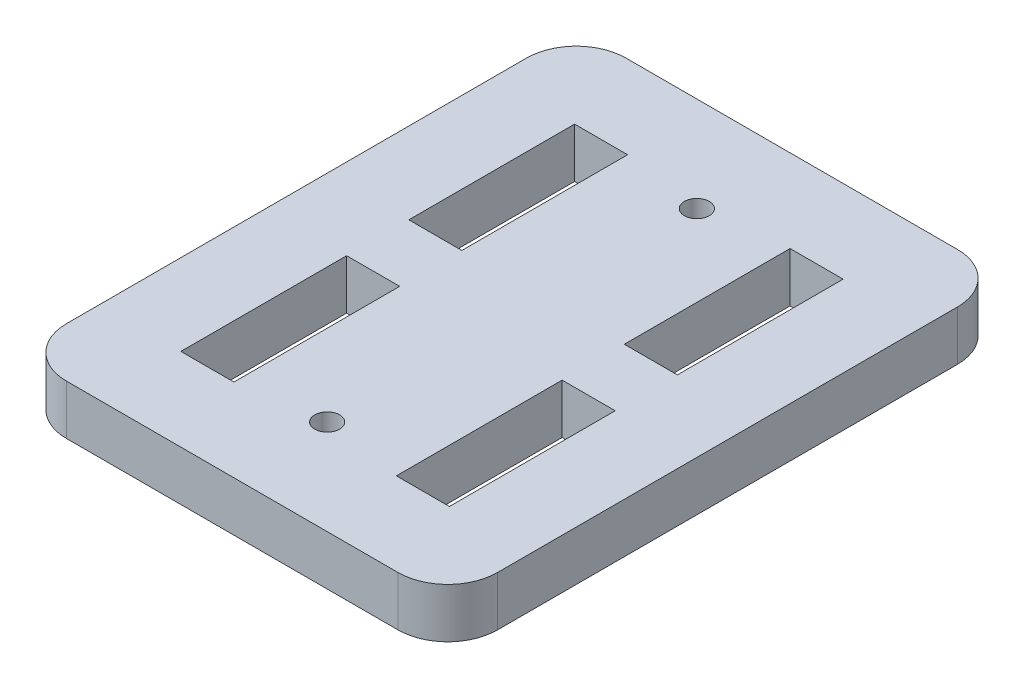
ISO-10303-21;
HEADER;
FILE_DESCRIPTION(('STEP AP214'),'2;1');
FILE_NAME('part.step','',(''),(''),'','','');
FILE_SCHEMA(('AUTOMOTIVE_DESIGN { 1 0 10303 214 1 1 1 1 }'));
ENDSEC;
DATA;
#1=APPLICATION_CONTEXT('core data for automotive mechanical design processes');
#2=APPLICATION_PROTOCOL_DEFINITION('international standard','automotive_design',2000,#1);
#3=PRODUCT_CONTEXT('',#1,'mechanical');
#4=PRODUCT('Part','Part','',(#3));
#5=PRODUCT_RELATED_PRODUCT_CATEGORY('part','',(#4));
#6=PRODUCT_DEFINITION_FORMATION('','',#4);
#7=PRODUCT_DEFINITION_CONTEXT('part definition',#1,'design');
#8=PRODUCT_DEFINITION('design','',#6,#7);
#9=PRODUCT_DEFINITION_SHAPE('','',#8);
#10=(LENGTH_UNIT() NAMED_UNIT(*) SI_UNIT(.MILLI.,.METRE.));
#11=(NAMED_UNIT(*) PLANE_ANGLE_UNIT() SI_UNIT($,.RADIAN.));
#12=(NAMED_UNIT(*) SI_UNIT($,.STERADIAN.) SOLID_ANGLE_UNIT());
#13=UNCERTAINTY_MEASURE_WITH_UNIT(LENGTH_MEASURE(1.E-05),#10,'distance_accuracy_value','');
#14=(GEOMETRIC_REPRESENTATION_CONTEXT(3) GLOBAL_UNCERTAINTY_ASSIGNED_CONTEXT((#13)) GLOBAL_UNIT_ASSIGNED_CONTEXT((#10,
#11,#12)) REPRESENTATION_CONTEXT('',''));
#15=CARTESIAN_POINT('',(0.,0.,0.));
#16=DIRECTION('',(0.,0.,1.));
#17=DIRECTION('',(1.,0.,0.));
#18=AXIS2_PLACEMENT_3D('',#15,#16,#17);
#19=CARTESIAN_POINT('',(0.,3.,0.));
#20=DIRECTION('',(0.,1.,0.));
#21=DIRECTION('',(0.,0.,1.));
#22=AXIS2_PLACEMENT_3D('',#19,#20,#21);
#23=PLANE('',#22);
#24=DIRECTION('',(0.,0.,1.));
#25=VECTOR('',#24,1.);
#26=CARTESIAN_POINT('',(16.2,3.,3.75));
#27=LINE('',#26,#25);
#28=CARTESIAN_POINT('',(16.2,3.,23.75));
#29=VERTEX_POINT('',#28);
#30=CARTESIAN_POINT('',(16.2,3.,3.75));
#31=VERTEX_POINT('',#30);
#32=EDGE_CURVE('E319',#29,#31,#27,.F.);
#33=ORIENTED_EDGE('',*,*,#32,.F.);
#34=DIRECTION('',(-1.,0.,0.));
#35=VECTOR('',#34,1.);
#36=CARTESIAN_POINT('',(16.2,3.,23.75));
#37=LINE('',#36,#35);
#38=CARTESIAN_POINT('',(9.8,3.,23.75));
#39=VERTEX_POINT('',#38);
#40=EDGE_CURVE('E306',#39,#29,#37,.F.);
#41=ORIENTED_EDGE('',*,*,#40,.F.);
#42=DIRECTION('',(0.,0.,-1.));
#43=VECTOR('',#42,1.);
#44=CARTESIAN_POINT('',(9.8,3.,23.75));
#45=LINE('',#44,#43);
#46=CARTESIAN_POINT('',(9.8,3.,3.75));
#47=VERTEX_POINT('',#46);
#48=EDGE_CURVE('E308',#47,#39,#45,.F.);
#49=ORIENTED_EDGE('',*,*,#48,.F.);
#50=DIRECTION('',(1.,0.,0.));
#51=VECTOR('',#50,1.);
#52=CARTESIAN_POINT('',(9.8,3.,3.75));
#53=LINE('',#52,#51);
#54=EDGE_CURVE('E312',#31,#47,#53,.F.);
#55=ORIENTED_EDGE('',*,*,#54,.F.);
#56=EDGE_LOOP('',(#33,#41,#49,#55));
#57=FACE_BOUND('',#56,.T.);
#58=DIRECTION('',(-1.,0.,0.));
#59=VECTOR('',#58,1.);
#60=CARTESIAN_POINT('',(-9.8,3.,23.75));
#61=LINE('',#60,#59);
#62=CARTESIAN_POINT('',(-16.2,3.,23.75));
#63=VERTEX_POINT('',#62);
#64=CARTESIAN_POINT('',(-9.8,3.,23.75));
#65=VERTEX_POINT('',#64);
#66=EDGE_CURVE('E302',#63,#65,#61,.F.);
#67=ORIENTED_EDGE('',*,*,#66,.F.);
#68=DIRECTION('',(0.,0.,-1.));
#69=VECTOR('',#68,1.);
#70=CARTESIAN_POINT('',(-16.2,3.,23.75));
#71=LINE('',#70,#69);
#72=CARTESIAN_POINT('',(-16.2,3.,3.75));
#73=VERTEX_POINT('',#72);
#74=EDGE_CURVE('E289',#73,#63,#71,.F.);
#75=ORIENTED_EDGE('',*,*,#74,.F.);
#76=DIRECTION('',(1.,0.,0.));
#77=VECTOR('',#76,1.);
#78=CARTESIAN_POINT('',(-16.2,3.,3.75));
#79=LINE('',#78,#77);
#80=CARTESIAN_POINT('',(-9.8,3.,3.75));
#81=VERTEX_POINT('',#80);
#82=EDGE_CURVE('E291',#81,#73,#79,.F.);
#83=ORIENTED_EDGE('',*,*,#82,.F.);
#84=DIRECTION('',(0.,0.,1.));
#85=VECTOR('',#84,1.);
#86=CARTESIAN_POINT('',(-9.8,3.,3.75));
#87=LINE('',#86,#85);
#88=EDGE_CURVE('E295',#65,#81,#87,.F.);
#89=ORIENTED_EDGE('',*,*,#88,.F.);
#90=EDGE_LOOP('',(#67,#75,#83,#89));
#91=FACE_BOUND('',#90,.T.);
#92=DIRECTION('',(1.,0.,0.));
#93=VECTOR('',#92,1.);
#94=CARTESIAN_POINT('',(9.8,3.,-23.75));
#95=LINE('',#94,#93);
#96=CARTESIAN_POINT('',(16.2,3.,-23.75));
#97=VERTEX_POINT('',#96);
#98=CARTESIAN_POINT('',(9.8,3.,-23.75));
#99=VERTEX_POINT('',#98);
#100=EDGE_CURVE('E285',#97,#99,#95,.F.);
#101=ORIENTED_EDGE('',*,*,#100,.F.);
#102=DIRECTION('',(0.,0.,1.));
#103=VECTOR('',#102,1.);
#104=CARTESIAN_POINT('',(16.2,3.,-23.75));
#105=LINE('',#104,#103);
#106=CARTESIAN_POINT('',(16.2,3.,-3.75));
#107=VERTEX_POINT('',#106);
#108=EDGE_CURVE('E272',#107,#97,#105,.F.);
#109=ORIENTED_EDGE('',*,*,#108,.F.);
#110=DIRECTION('',(-1.,0.,0.));
#111=VECTOR('',#110,1.);
#112=CARTESIAN_POINT('',(16.2,3.,-3.75));
#113=LINE('',#112,#111);
#114=CARTESIAN_POINT('',(9.8,3.,-3.75));
#115=VERTEX_POINT('',#114);
#116=EDGE_CURVE('E274',#115,#107,#113,.F.);
#117=ORIENTED_EDGE('',*,*,#116,.F.);
#118=DIRECTION('',(0.,0.,-1.));
#119=VECTOR('',#118,1.);
#120=CARTESIAN_POINT('',(9.8,3.,-3.75));
#121=LINE('',#120,#119);
#122=EDGE_CURVE('E278',#99,#115,#121,.F.);
#123=ORIENTED_EDGE('',*,*,#122,.F.);
#124=EDGE_LOOP('',(#101,#109,#117,#123));
#125=FACE_BOUND('',#124,.T.);
#126=DIRECTION('',(0.,0.,-1.));
#127=VECTOR('',#126,1.);
#128=CARTESIAN_POINT('',(-16.2,3.,-3.75));
#129=LINE('',#128,#127);
#130=CARTESIAN_POINT('',(-16.2,3.,-23.75));
#131=VERTEX_POINT('',#130);
#132=CARTESIAN_POINT('',(-16.2,3.,-3.75));
#133=VERTEX_POINT('',#132);
#134=EDGE_CURVE('E268',#131,#133,#129,.F.);
#135=ORIENTED_EDGE('',*,*,#134,.F.);
#136=DIRECTION('',(1.,0.,0.));
#137=VECTOR('',#136,1.);
#138=CARTESIAN_POINT('',(-16.2,3.,-23.75));
#139=LINE('',#138,#137);
#140=CARTESIAN_POINT('',(-9.8,3.,-23.75));
#141=VERTEX_POINT('',#140);
#142=EDGE_CURVE('E234',#141,#131,#139,.F.);
#143=ORIENTED_EDGE('',*,*,#142,.F.);
#144=DIRECTION('',(0.,0.,1.));
#145=VECTOR('',#144,1.);
#146=CARTESIAN_POINT('',(-9.8,3.,-23.75));
#147=LINE('',#146,#145);
#148=CARTESIAN_POINT('',(-9.8,3.,-3.75));
#149=VERTEX_POINT('',#148);
#150=EDGE_CURVE('E257',#149,#141,#147,.F.);
#151=ORIENTED_EDGE('',*,*,#150,.F.);
#152=DIRECTION('',(-1.,0.,0.));
#153=VECTOR('',#152,1.);
#154=CARTESIAN_POINT('',(-9.8,3.,-3.75));
#155=LINE('',#154,#153);
#156=EDGE_CURVE('E261',#133,#149,#155,.F.);
#157=ORIENTED_EDGE('',*,*,#156,.F.);
#158=EDGE_LOOP('',(#135,#143,#151,#157));
#159=FACE_BOUND('',#158,.T.);
#160=CARTESIAN_POINT('',(0.,3.,22.3));
#161=DIRECTION('',(0.,1.,0.));
#162=DIRECTION('',(0.,0.,1.));
#163=AXIS2_PLACEMENT_3D('',#160,#161,#162);
#164=CIRCLE('',#163,1.5);
#165=CARTESIAN_POINT('',(0.,3.,23.8));
#166=VERTEX_POINT('',#165);
#167=EDGE_CURVE('E231',#166,#166,#164,.F.);
#168=ORIENTED_EDGE('',*,*,#167,.T.);
#169=EDGE_LOOP('',(#168));
#170=FACE_BOUND('',#169,.T.);
#171=CARTESIAN_POINT('',(0.,3.,-22.3));
#172=DIRECTION('',(0.,1.,0.));
#173=DIRECTION('',(0.,0.,1.));
#174=AXIS2_PLACEMENT_3D('',#171,#172,#173);
#175=CIRCLE('',#174,1.5);
#176=CARTESIAN_POINT('',(0.,3.,-20.8));
#177=VERTEX_POINT('',#176);
#178=EDGE_CURVE('E235',#177,#177,#175,.F.);
#179=ORIENTED_EDGE('',*,*,#178,.T.);
#180=EDGE_LOOP('',(#179));
#181=FACE_BOUND('',#180,.T.);
#182=DIRECTION('',(-1.,0.,0.));
#183=VECTOR('',#182,1.);
#184=CARTESIAN_POINT('',(20.,3.,-33.75));
#185=LINE('',#184,#183);
#186=CARTESIAN_POINT('',(-20.,3.,-33.75));
#187=VERTEX_POINT('',#186);
#188=CARTESIAN_POINT('',(20.,3.,-33.75));
#189=VERTEX_POINT('',#188);
#190=EDGE_CURVE('E188',#187,#189,#185,.F.);
#191=ORIENTED_EDGE('',*,*,#190,.F.);
#192=CARTESIAN_POINT('',(-20.,3.,-27.75));
#193=DIRECTION('',(0.,1.,0.));
#194=DIRECTION('',(0.,0.,1.));
#195=AXIS2_PLACEMENT_3D('',#192,#193,#194);
#196=CIRCLE('',#195,6.);
#197=CARTESIAN_POINT('',(-26.,3.,-27.75));
#198=VERTEX_POINT('',#197);
#199=EDGE_CURVE('E20',#198,#187,#196,.F.);
#200=ORIENTED_EDGE('',*,*,#199,.F.);
#201=DIRECTION('',(0.,0.,1.));
#202=VECTOR('',#201,1.);
#203=CARTESIAN_POINT('',(-26.,3.,-27.75));
#204=LINE('',#203,#202);
#205=CARTESIAN_POINT('',(-26.,3.,27.75));
#206=VERTEX_POINT('',#205);
#207=EDGE_CURVE('E174',#206,#198,#204,.F.);
#208=ORIENTED_EDGE('',*,*,#207,.F.);
#209=CARTESIAN_POINT('',(-20.,3.,27.75));
#210=DIRECTION('',(0.,1.,0.));
#211=DIRECTION('',(0.,0.,1.));
#212=AXIS2_PLACEMENT_3D('',#209,#210,#211);
#213=CIRCLE('',#212,6.);
#214=CARTESIAN_POINT('',(-20.,3.,33.75));
#215=VERTEX_POINT('',#214);
#216=EDGE_CURVE('E195',#215,#206,#213,.F.);
#217=ORIENTED_EDGE('',*,*,#216,.F.);
#218=DIRECTION('',(1.,0.,0.));
#219=VECTOR('',#218,1.);
#220=CARTESIAN_POINT('',(-20.,3.,33.75));
#221=LINE('',#220,#219);
#222=CARTESIAN_POINT('',(20.,3.,33.75));
#223=VERTEX_POINT('',#222);
#224=EDGE_CURVE('E207',#223,#215,#221,.F.);
#225=ORIENTED_EDGE('',*,*,#224,.F.);
#226=CARTESIAN_POINT('',(20.,3.,27.75));
#227=DIRECTION('',(0.,1.,0.));
#228=DIRECTION('',(0.,0.,1.));
#229=AXIS2_PLACEMENT_3D('',#226,#227,#228);
#230=CIRCLE('',#229,6.);
#231=CARTESIAN_POINT('',(26.,3.,27.75));
#232=VERTEX_POINT('',#231);
#233=EDGE_CURVE('E241',#232,#223,#230,.F.);
#234=ORIENTED_EDGE('',*,*,#233,.F.);
#235=DIRECTION('',(0.,0.,-1.));
#236=VECTOR('',#235,1.);
#237=CARTESIAN_POINT('',(26.,3.,27.75));
#238=LINE('',#237,#236);
#239=CARTESIAN_POINT('',(26.,3.,-27.75));
#240=VERTEX_POINT('',#239);
#241=EDGE_CURVE('E203',#240,#232,#238,.F.);
#242=ORIENTED_EDGE('',*,*,#241,.F.);
#243=CARTESIAN_POINT('',(20.,3.,-27.75));
#244=DIRECTION('',(0.,1.,0.));
#245=DIRECTION('',(0.,0.,1.));
#246=AXIS2_PLACEMENT_3D('',#243,#244,#245);
#247=CIRCLE('',#246,6.);
#248=EDGE_CURVE('E238',#189,#240,#247,.F.);
#249=ORIENTED_EDGE('',*,*,#248,.F.);
#250=EDGE_LOOP('',(#191,#200,#208,#217,#225,#234,#242,#249));
#251=FACE_BOUND('',#250,.T.);
#252=ADVANCED_FACE('F17',(#57,#91,#125,#159,#170,#181,#251),#23,.T.);
#253=CARTESIAN_POINT('',(-20.,-3.,-27.75));
#254=DIRECTION('',(0.,1.,0.));
#255=DIRECTION('',(0.,0.,1.));
#256=AXIS2_PLACEMENT_3D('',#253,#254,#255);
#257=CYLINDRICAL_SURFACE('',#256,6.);
#258=DIRECTION('',(0.,1.,0.));
#259=VECTOR('',#258,1.);
#260=CARTESIAN_POINT('',(-20.,-3.,-33.75));
#261=LINE('',#260,#259);
#262=CARTESIAN_POINT('',(-20.,-3.,-33.75));
#263=VERTEX_POINT('',#262);
#264=EDGE_CURVE('E202',#263,#187,#261,.T.);
#265=ORIENTED_EDGE('',*,*,#264,.F.);
#266=CARTESIAN_POINT('',(-20.,-3.,-27.75));
#267=DIRECTION('',(0.,1.,0.));
#268=DIRECTION('',(0.,0.,1.));
#269=AXIS2_PLACEMENT_3D('',#266,#267,#268);
#270=CIRCLE('',#269,6.);
#271=CARTESIAN_POINT('',(-26.,-3.,-27.75));
#272=VERTEX_POINT('',#271);
#273=EDGE_CURVE('E194',#263,#272,#270,.T.);
#274=ORIENTED_EDGE('',*,*,#273,.T.);
#275=DIRECTION('',(0.,1.,0.));
#276=VECTOR('',#275,1.);
#277=CARTESIAN_POINT('',(-26.,-3.,-27.75));
#278=LINE('',#277,#276);
#279=EDGE_CURVE('E179',#198,#272,#278,.F.);
#280=ORIENTED_EDGE('',*,*,#279,.F.);
#281=ORIENTED_EDGE('',*,*,#199,.T.);
#282=EDGE_LOOP('',(#265,#274,#280,#281));
#283=FACE_BOUND('',#282,.T.);
#284=ADVANCED_FACE('F193',(#283),#257,.T.);
#285=CARTESIAN_POINT('',(-26.,-3.,-27.75));
#286=DIRECTION('',(-1.,0.,0.));
#287=DIRECTION('',(0.,0.,1.));
#288=AXIS2_PLACEMENT_3D('',#285,#286,#287);
#289=PLANE('',#288);
#290=ORIENTED_EDGE('',*,*,#279,.T.);
#291=DIRECTION('',(0.,0.,1.));
#292=VECTOR('',#291,1.);
#293=CARTESIAN_POINT('',(-26.,-3.,0.));
#294=LINE('',#293,#292);
#295=CARTESIAN_POINT('',(-26.,-3.,27.75));
#296=VERTEX_POINT('',#295);
#297=EDGE_CURVE('E229',#272,#296,#294,.T.);
#298=ORIENTED_EDGE('',*,*,#297,.T.);
#299=DIRECTION('',(0.,1.,0.));
#300=VECTOR('',#299,1.);
#301=CARTESIAN_POINT('',(-26.,-3.,27.75));
#302=LINE('',#301,#300);
#303=EDGE_CURVE('E181',#206,#296,#302,.F.);
#304=ORIENTED_EDGE('',*,*,#303,.F.);
#305=ORIENTED_EDGE('',*,*,#207,.T.);
#306=EDGE_LOOP('',(#290,#298,#304,#305));
#307=FACE_BOUND('',#306,.T.);
#308=ADVANCED_FACE('F176',(#307),#289,.T.);
#309=CARTESIAN_POINT('',(-20.,-3.,27.75));
#310=DIRECTION('',(0.,1.,0.));
#311=DIRECTION('',(0.,0.,1.));
#312=AXIS2_PLACEMENT_3D('',#309,#310,#311);
#313=CYLINDRICAL_SURFACE('',#312,6.);
#314=ORIENTED_EDGE('',*,*,#303,.T.);
#315=CARTESIAN_POINT('',(-20.,-3.,27.75));
#316=DIRECTION('',(0.,1.,0.));
#317=DIRECTION('',(0.,0.,1.));
#318=AXIS2_PLACEMENT_3D('',#315,#316,#317);
#319=CIRCLE('',#318,6.);
#320=CARTESIAN_POINT('',(-20.,-3.,33.75));
#321=VERTEX_POINT('',#320);
#322=EDGE_CURVE('E226',#296,#321,#319,.T.);
#323=ORIENTED_EDGE('',*,*,#322,.T.);
#324=DIRECTION('',(0.,1.,0.));
#325=VECTOR('',#324,1.);
#326=CARTESIAN_POINT('',(-20.,-3.,33.75));
#327=LINE('',#326,#325);
#328=EDGE_CURVE('E208',#215,#321,#327,.F.);
#329=ORIENTED_EDGE('',*,*,#328,.F.);
#330=ORIENTED_EDGE('',*,*,#216,.T.);
#331=EDGE_LOOP('',(#314,#323,#329,#330));
#332=FACE_BOUND('',#331,.T.);
#333=ADVANCED_FACE('F476',(#332),#313,.T.);
#334=CARTESIAN_POINT('',(-20.,-3.,33.75));
#335=DIRECTION('',(0.,0.,1.));
#336=DIRECTION('',(1.,0.,0.));
#337=AXIS2_PLACEMENT_3D('',#334,#335,#336);
#338=PLANE('',#337);
#339=ORIENTED_EDGE('',*,*,#328,.T.);
#340=DIRECTION('',(1.,0.,0.));
#341=VECTOR('',#340,1.);
#342=CARTESIAN_POINT('',(0.,-3.,33.75));
#343=LINE('',#342,#341);
#344=CARTESIAN_POINT('',(20.,-3.,33.75));
#345=VERTEX_POINT('',#344);
#346=EDGE_CURVE('E225',#321,#345,#343,.T.);
#347=ORIENTED_EDGE('',*,*,#346,.T.);
#348=DIRECTION('',(0.,1.,0.));
#349=VECTOR('',#348,1.);
#350=CARTESIAN_POINT('',(20.,-3.,33.75));
#351=LINE('',#350,#349);
#352=EDGE_CURVE('E206',#223,#345,#351,.F.);
#353=ORIENTED_EDGE('',*,*,#352,.F.);
#354=ORIENTED_EDGE('',*,*,#224,.T.);
#355=EDGE_LOOP('',(#339,#347,#353,#354));
#356=FACE_BOUND('',#355,.T.);
#357=ADVANCED_FACE('F473',(#356),#338,.T.);
#358=CARTESIAN_POINT('',(20.,-3.,27.75));
#359=DIRECTION('',(0.,1.,0.));
#360=DIRECTION('',(0.,0.,1.));
#361=AXIS2_PLACEMENT_3D('',#358,#359,#360);
#362=CYLINDRICAL_SURFACE('',#361,6.);
#363=ORIENTED_EDGE('',*,*,#352,.T.);
#364=CARTESIAN_POINT('',(20.,-3.,27.75));
#365=DIRECTION('',(0.,1.,0.));
#366=DIRECTION('',(0.,0.,1.));
#367=AXIS2_PLACEMENT_3D('',#364,#365,#366);
#368=CIRCLE('',#367,6.);
#369=CARTESIAN_POINT('',(26.,-3.,27.75));
#370=VERTEX_POINT('',#369);
#371=EDGE_CURVE('E222',#345,#370,#368,.T.);
#372=ORIENTED_EDGE('',*,*,#371,.T.);
#373=DIRECTION('',(0.,1.,0.));
#374=VECTOR('',#373,1.);
#375=CARTESIAN_POINT('',(26.,-3.,27.75));
#376=LINE('',#375,#374);
#377=EDGE_CURVE('E205',#232,#370,#376,.F.);
#378=ORIENTED_EDGE('',*,*,#377,.F.);
#379=ORIENTED_EDGE('',*,*,#233,.T.);
#380=EDGE_LOOP('',(#363,#372,#378,#379));
#381=FACE_BOUND('',#380,.T.);
#382=ADVANCED_FACE('F469',(#381),#362,.T.);
#383=CARTESIAN_POINT('',(26.,-3.,27.75));
#384=DIRECTION('',(1.,0.,0.));
#385=DIRECTION('',(0.,0.,-1.));
#386=AXIS2_PLACEMENT_3D('',#383,#384,#385);
#387=PLANE('',#386);
#388=ORIENTED_EDGE('',*,*,#377,.T.);
#389=DIRECTION('',(0.,0.,1.));
#390=VECTOR('',#389,1.);
#391=CARTESIAN_POINT('',(26.,-3.,0.));
#392=LINE('',#391,#390);
#393=CARTESIAN_POINT('',(26.,-3.,-27.75));
#394=VERTEX_POINT('',#393);
#395=EDGE_CURVE('E221',#370,#394,#392,.F.);
#396=ORIENTED_EDGE('',*,*,#395,.T.);
#397=DIRECTION('',(0.,1.,0.));
#398=VECTOR('',#397,1.);
#399=CARTESIAN_POINT('',(26.,-3.,-27.75));
#400=LINE('',#399,#398);
#401=EDGE_CURVE('E240',#240,#394,#400,.F.);
#402=ORIENTED_EDGE('',*,*,#401,.F.);
#403=ORIENTED_EDGE('',*,*,#241,.T.);
#404=EDGE_LOOP('',(#388,#396,#402,#403));
#405=FACE_BOUND('',#404,.T.);
#406=ADVANCED_FACE('F465',(#405),#387,.T.);
#407=CARTESIAN_POINT('',(20.,-3.,-27.75));
#408=DIRECTION('',(0.,1.,0.));
#409=DIRECTION('',(0.,0.,1.));
#410=AXIS2_PLACEMENT_3D('',#407,#408,#409);
#411=CYLINDRICAL_SURFACE('',#410,6.);
#412=ORIENTED_EDGE('',*,*,#401,.T.);
#413=CARTESIAN_POINT('',(20.,-3.,-27.75));
#414=DIRECTION('',(0.,1.,0.));
#415=DIRECTION('',(0.,0.,1.));
#416=AXIS2_PLACEMENT_3D('',#413,#414,#415);
#417=CIRCLE('',#416,6.);
#418=CARTESIAN_POINT('',(20.,-3.,-33.75));
#419=VERTEX_POINT('',#418);
#420=EDGE_CURVE('E218',#394,#419,#417,.T.);
#421=ORIENTED_EDGE('',*,*,#420,.T.);
#422=DIRECTION('',(0.,1.,0.));
#423=VECTOR('',#422,1.);
#424=CARTESIAN_POINT('',(20.,-3.,-33.75));
#425=LINE('',#424,#423);
#426=EDGE_CURVE('E201',#189,#419,#425,.F.);
#427=ORIENTED_EDGE('',*,*,#426,.F.);
#428=ORIENTED_EDGE('',*,*,#248,.T.);
#429=EDGE_LOOP('',(#412,#421,#427,#428));
#430=FACE_BOUND('',#429,.T.);
#431=ADVANCED_FACE('F461',(#430),#411,.T.);
#432=CARTESIAN_POINT('',(20.,-3.,-33.75));
#433=DIRECTION('',(0.,0.,-1.));
#434=DIRECTION('',(-1.,0.,0.));
#435=AXIS2_PLACEMENT_3D('',#432,#433,#434);
#436=PLANE('',#435);
#437=ORIENTED_EDGE('',*,*,#426,.T.);
#438=DIRECTION('',(1.,0.,0.));
#439=VECTOR('',#438,1.);
#440=CARTESIAN_POINT('',(0.,-3.,-33.75));
#441=LINE('',#440,#439);
#442=EDGE_CURVE('E217',#419,#263,#441,.F.);
#443=ORIENTED_EDGE('',*,*,#442,.T.);
#444=ORIENTED_EDGE('',*,*,#264,.T.);
#445=ORIENTED_EDGE('',*,*,#190,.T.);
#446=EDGE_LOOP('',(#437,#443,#444,#445));
#447=FACE_BOUND('',#446,.T.);
#448=ADVANCED_FACE('F457',(#447),#436,.T.);
#449=CARTESIAN_POINT('',(0.,-3.,-22.3));
#450=DIRECTION('',(0.,1.,0.));
#451=DIRECTION('',(0.,0.,1.));
#452=AXIS2_PLACEMENT_3D('',#449,#450,#451);
#453=CYLINDRICAL_SURFACE('',#452,1.5);
#454=ORIENTED_EDGE('',*,*,#178,.F.);
#455=EDGE_LOOP('',(#454));
#456=FACE_BOUND('',#455,.T.);
#457=CARTESIAN_POINT('',(0.,-3.,-22.3));
#458=DIRECTION('',(0.,1.,0.));
#459=DIRECTION('',(0.,0.,1.));
#460=AXIS2_PLACEMENT_3D('',#457,#458,#459);
#461=CIRCLE('',#460,1.5);
#462=CARTESIAN_POINT('',(0.,-3.,-20.8));
#463=VERTEX_POINT('',#462);
#464=EDGE_CURVE('E214',#463,#463,#461,.F.);
#465=ORIENTED_EDGE('',*,*,#464,.T.);
#466=EDGE_LOOP('',(#465));
#467=FACE_BOUND('',#466,.T.);
#468=ADVANCED_FACE('F453',(#456,#467),#453,.F.);
#469=CARTESIAN_POINT('',(0.,-3.,22.3));
#470=DIRECTION('',(0.,1.,0.));
#471=DIRECTION('',(0.,0.,1.));
#472=AXIS2_PLACEMENT_3D('',#469,#470,#471);
#473=CYLINDRICAL_SURFACE('',#472,1.5);
#474=ORIENTED_EDGE('',*,*,#167,.F.);
#475=EDGE_LOOP('',(#474));
#476=FACE_BOUND('',#475,.T.);
#477=CARTESIAN_POINT('',(0.,-3.,22.3));
#478=DIRECTION('',(0.,1.,0.));
#479=DIRECTION('',(0.,0.,1.));
#480=AXIS2_PLACEMENT_3D('',#477,#478,#479);
#481=CIRCLE('',#480,1.5);
#482=CARTESIAN_POINT('',(0.,-3.,23.8));
#483=VERTEX_POINT('',#482);
#484=EDGE_CURVE('E210',#483,#483,#481,.F.);
#485=ORIENTED_EDGE('',*,*,#484,.T.);
#486=EDGE_LOOP('',(#485));
#487=FACE_BOUND('',#486,.T.);
#488=ADVANCED_FACE('F449',(#476,#487),#473,.F.);
#489=CARTESIAN_POINT('',(-16.2,-3.,-23.75));
#490=DIRECTION('',(0.,0.,1.));
#491=DIRECTION('',(1.,0.,0.));
#492=AXIS2_PLACEMENT_3D('',#489,#490,#491);
#493=PLANE('',#492);
#494=DIRECTION('',(0.,1.,0.));
#495=VECTOR('',#494,1.);
#496=CARTESIAN_POINT('',(-16.2,-3.,-23.75));
#497=LINE('',#496,#495);
#498=CARTESIAN_POINT('',(-16.2,-3.,-23.75));
#499=VERTEX_POINT('',#498);
#500=EDGE_CURVE('E265',#499,#131,#497,.T.);
#501=ORIENTED_EDGE('',*,*,#500,.F.);
#502=DIRECTION('',(1.,0.,0.));
#503=VECTOR('',#502,1.);
#504=CARTESIAN_POINT('',(0.,-3.,-23.75));
#505=LINE('',#504,#503);
#506=CARTESIAN_POINT('',(-9.8,-3.,-23.75));
#507=VERTEX_POINT('',#506);
#508=EDGE_CURVE('E213',#499,#507,#505,.T.);
#509=ORIENTED_EDGE('',*,*,#508,.T.);
#510=DIRECTION('',(0.,1.,0.));
#511=VECTOR('',#510,1.);
#512=CARTESIAN_POINT('',(-9.8,-3.,-23.75));
#513=LINE('',#512,#511);
#514=EDGE_CURVE('E259',#141,#507,#513,.F.);
#515=ORIENTED_EDGE('',*,*,#514,.F.);
#516=ORIENTED_EDGE('',*,*,#142,.T.);
#517=EDGE_LOOP('',(#501,#509,#515,#516));
#518=FACE_BOUND('',#517,.T.);
#519=ADVANCED_FACE('F445',(#518),#493,.T.);
#520=CARTESIAN_POINT('',(-9.8,-3.,-23.75));
#521=DIRECTION('',(-1.,0.,0.));
#522=DIRECTION('',(0.,0.,1.));
#523=AXIS2_PLACEMENT_3D('',#520,#521,#522);
#524=PLANE('',#523);
#525=ORIENTED_EDGE('',*,*,#514,.T.);
#526=DIRECTION('',(0.,0.,1.));
#527=VECTOR('',#526,1.);
#528=CARTESIAN_POINT('',(-9.8,-3.,0.));
#529=LINE('',#528,#527);
#530=CARTESIAN_POINT('',(-9.8,-3.,-3.75));
#531=VERTEX_POINT('',#530);
#532=EDGE_CURVE('E330',#507,#531,#529,.T.);
#533=ORIENTED_EDGE('',*,*,#532,.T.);
#534=DIRECTION('',(0.,1.,0.));
#535=VECTOR('',#534,1.);
#536=CARTESIAN_POINT('',(-9.8,-3.,-3.75));
#537=LINE('',#536,#535);
#538=EDGE_CURVE('E263',#149,#531,#537,.F.);
#539=ORIENTED_EDGE('',*,*,#538,.F.);
#540=ORIENTED_EDGE('',*,*,#150,.T.);
#541=EDGE_LOOP('',(#525,#533,#539,#540));
#542=FACE_BOUND('',#541,.T.);
#543=ADVANCED_FACE('F441',(#542),#524,.T.);
#544=CARTESIAN_POINT('',(-9.8,-3.,-3.75));
#545=DIRECTION('',(0.,0.,-1.));
#546=DIRECTION('',(-1.,0.,0.));
#547=AXIS2_PLACEMENT_3D('',#544,#545,#546);
#548=PLANE('',#547);
#549=ORIENTED_EDGE('',*,*,#538,.T.);
#550=DIRECTION('',(1.,0.,0.));
#551=VECTOR('',#550,1.);
#552=CARTESIAN_POINT('',(0.,-3.,-3.75));
#553=LINE('',#552,#551);
#554=CARTESIAN_POINT('',(-16.2,-3.,-3.75));
#555=VERTEX_POINT('',#554);
#556=EDGE_CURVE('E333',#531,#555,#553,.F.);
#557=ORIENTED_EDGE('',*,*,#556,.T.);
#558=DIRECTION('',(0.,1.,0.));
#559=VECTOR('',#558,1.);
#560=CARTESIAN_POINT('',(-16.2,-3.,-3.75));
#561=LINE('',#560,#559);
#562=EDGE_CURVE('E270',#133,#555,#561,.F.);
#563=ORIENTED_EDGE('',*,*,#562,.F.);
#564=ORIENTED_EDGE('',*,*,#156,.T.);
#565=EDGE_LOOP('',(#549,#557,#563,#564));
#566=FACE_BOUND('',#565,.T.);
#567=ADVANCED_FACE('F437',(#566),#548,.T.);
#568=CARTESIAN_POINT('',(-16.2,-3.,-3.75));
#569=DIRECTION('',(1.,0.,0.));
#570=DIRECTION('',(0.,0.,-1.));
#571=AXIS2_PLACEMENT_3D('',#568,#569,#570);
#572=PLANE('',#571);
#573=ORIENTED_EDGE('',*,*,#562,.T.);
#574=DIRECTION('',(0.,0.,1.));
#575=VECTOR('',#574,1.);
#576=CARTESIAN_POINT('',(-16.2,-3.,0.));
#577=LINE('',#576,#575);
#578=EDGE_CURVE('E336',#555,#499,#577,.F.);
#579=ORIENTED_EDGE('',*,*,#578,.T.);
#580=ORIENTED_EDGE('',*,*,#500,.T.);
#581=ORIENTED_EDGE('',*,*,#134,.T.);
#582=EDGE_LOOP('',(#573,#579,#580,#581));
#583=FACE_BOUND('',#582,.T.);
#584=ADVANCED_FACE('F433',(#583),#572,.T.);
#585=CARTESIAN_POINT('',(16.2,-3.,-23.75));
#586=DIRECTION('',(-1.,0.,0.));
#587=DIRECTION('',(0.,0.,1.));
#588=AXIS2_PLACEMENT_3D('',#585,#586,#587);
#589=PLANE('',#588);
#590=DIRECTION('',(0.,1.,0.));
#591=VECTOR('',#590,1.);
#592=CARTESIAN_POINT('',(16.2,-3.,-23.75));
#593=LINE('',#592,#591);
#594=CARTESIAN_POINT('',(16.2,-3.,-23.75));
#595=VERTEX_POINT('',#594);
#596=EDGE_CURVE('E282',#595,#97,#593,.T.);
#597=ORIENTED_EDGE('',*,*,#596,.F.);
#598=DIRECTION('',(0.,0.,1.));
#599=VECTOR('',#598,1.);
#600=CARTESIAN_POINT('',(16.2,-3.,0.));
#601=LINE('',#600,#599);
#602=CARTESIAN_POINT('',(16.2,-3.,-3.75));
#603=VERTEX_POINT('',#602);
#604=EDGE_CURVE('E339',#595,#603,#601,.T.);
#605=ORIENTED_EDGE('',*,*,#604,.T.);
#606=DIRECTION('',(0.,1.,0.));
#607=VECTOR('',#606,1.);
#608=CARTESIAN_POINT('',(16.2,-3.,-3.75));
#609=LINE('',#608,#607);
#610=EDGE_CURVE('E276',#107,#603,#609,.F.);
#611=ORIENTED_EDGE('',*,*,#610,.F.);
#612=ORIENTED_EDGE('',*,*,#108,.T.);
#613=EDGE_LOOP('',(#597,#605,#611,#612));
#614=FACE_BOUND('',#613,.T.);
#615=ADVANCED_FACE('F429',(#614),#589,.T.);
#616=CARTESIAN_POINT('',(16.2,-3.,-3.75));
#617=DIRECTION('',(0.,0.,-1.));
#618=DIRECTION('',(-1.,0.,0.));
#619=AXIS2_PLACEMENT_3D('',#616,#617,#618);
#620=PLANE('',#619);
#621=ORIENTED_EDGE('',*,*,#610,.T.);
#622=DIRECTION('',(1.,0.,0.));
#623=VECTOR('',#622,1.);
#624=CARTESIAN_POINT('',(0.,-3.,-3.75));
#625=LINE('',#624,#623);
#626=CARTESIAN_POINT('',(9.8,-3.,-3.75));
#627=VERTEX_POINT('',#626);
#628=EDGE_CURVE('E342',#603,#627,#625,.F.);
#629=ORIENTED_EDGE('',*,*,#628,.T.);
#630=DIRECTION('',(0.,1.,0.));
#631=VECTOR('',#630,1.);
#632=CARTESIAN_POINT('',(9.8,-3.,-3.75));
#633=LINE('',#632,#631);
#634=EDGE_CURVE('E280',#115,#627,#633,.F.);
#635=ORIENTED_EDGE('',*,*,#634,.F.);
#636=ORIENTED_EDGE('',*,*,#116,.T.);
#637=EDGE_LOOP('',(#621,#629,#635,#636));
#638=FACE_BOUND('',#637,.T.);
#639=ADVANCED_FACE('F425',(#638),#620,.T.);
#640=CARTESIAN_POINT('',(9.8,-3.,-3.75));
#641=DIRECTION('',(1.,0.,0.));
#642=DIRECTION('',(0.,0.,-1.));
#643=AXIS2_PLACEMENT_3D('',#640,#641,#642);
#644=PLANE('',#643);
#645=ORIENTED_EDGE('',*,*,#634,.T.);
#646=DIRECTION('',(0.,0.,1.));
#647=VECTOR('',#646,1.);
#648=CARTESIAN_POINT('',(9.8,-3.,0.));
#649=LINE('',#648,#647);
#650=CARTESIAN_POINT('',(9.8,-3.,-23.75));
#651=VERTEX_POINT('',#650);
#652=EDGE_CURVE('E345',#627,#651,#649,.F.);
#653=ORIENTED_EDGE('',*,*,#652,.T.);
#654=DIRECTION('',(0.,1.,0.));
#655=VECTOR('',#654,1.);
#656=CARTESIAN_POINT('',(9.8,-3.,-23.75));
#657=LINE('',#656,#655);
#658=EDGE_CURVE('E287',#99,#651,#657,.F.);
#659=ORIENTED_EDGE('',*,*,#658,.F.);
#660=ORIENTED_EDGE('',*,*,#122,.T.);
#661=EDGE_LOOP('',(#645,#653,#659,#660));
#662=FACE_BOUND('',#661,.T.);
#663=ADVANCED_FACE('F421',(#662),#644,.T.);
#664=CARTESIAN_POINT('',(9.8,-3.,-23.75));
#665=DIRECTION('',(0.,0.,1.));
#666=DIRECTION('',(1.,0.,0.));
#667=AXIS2_PLACEMENT_3D('',#664,#665,#666);
#668=PLANE('',#667);
#669=ORIENTED_EDGE('',*,*,#658,.T.);
#670=DIRECTION('',(1.,0.,0.));
#671=VECTOR('',#670,1.);
#672=CARTESIAN_POINT('',(0.,-3.,-23.75));
#673=LINE('',#672,#671);
#674=EDGE_CURVE('E348',#651,#595,#673,.T.);
#675=ORIENTED_EDGE('',*,*,#674,.T.);
#676=ORIENTED_EDGE('',*,*,#596,.T.);
#677=ORIENTED_EDGE('',*,*,#100,.T.);
#678=EDGE_LOOP('',(#669,#675,#676,#677));
#679=FACE_BOUND('',#678,.T.);
#680=ADVANCED_FACE('F417',(#679),#668,.T.);
#681=CARTESIAN_POINT('',(-16.2,-3.,23.75));
#682=DIRECTION('',(1.,0.,0.));
#683=DIRECTION('',(0.,0.,-1.));
#684=AXIS2_PLACEMENT_3D('',#681,#682,#683);
#685=PLANE('',#684);
#686=DIRECTION('',(0.,1.,0.));
#687=VECTOR('',#686,1.);
#688=CARTESIAN_POINT('',(-16.2,-3.,23.75));
#689=LINE('',#688,#687);
#690=CARTESIAN_POINT('',(-16.2,-3.,23.75));
#691=VERTEX_POINT('',#690);
#692=EDGE_CURVE('E299',#691,#63,#689,.T.);
#693=ORIENTED_EDGE('',*,*,#692,.F.);
#694=DIRECTION('',(0.,0.,1.));
#695=VECTOR('',#694,1.);
#696=CARTESIAN_POINT('',(-16.2,-3.,0.));
#697=LINE('',#696,#695);
#698=CARTESIAN_POINT('',(-16.2,-3.,3.75));
#699=VERTEX_POINT('',#698);
#700=EDGE_CURVE('E351',#691,#699,#697,.F.);
#701=ORIENTED_EDGE('',*,*,#700,.T.);
#702=DIRECTION('',(0.,1.,0.));
#703=VECTOR('',#702,1.);
#704=CARTESIAN_POINT('',(-16.2,-3.,3.75));
#705=LINE('',#704,#703);
#706=EDGE_CURVE('E293',#73,#699,#705,.F.);
#707=ORIENTED_EDGE('',*,*,#706,.F.);
#708=ORIENTED_EDGE('',*,*,#74,.T.);
#709=EDGE_LOOP('',(#693,#701,#707,#708));
#710=FACE_BOUND('',#709,.T.);
#711=ADVANCED_FACE('F413',(#710),#685,.T.);
#712=CARTESIAN_POINT('',(-16.2,-3.,3.75));
#713=DIRECTION('',(0.,0.,1.));
#714=DIRECTION('',(1.,0.,0.));
#715=AXIS2_PLACEMENT_3D('',#712,#713,#714);
#716=PLANE('',#715);
#717=ORIENTED_EDGE('',*,*,#706,.T.);
#718=DIRECTION('',(1.,0.,0.));
#719=VECTOR('',#718,1.);
#720=CARTESIAN_POINT('',(0.,-3.,3.75));
#721=LINE('',#720,#719);
#722=CARTESIAN_POINT('',(-9.8,-3.,3.75));
#723=VERTEX_POINT('',#722);
#724=EDGE_CURVE('E354',#699,#723,#721,.T.);
#725=ORIENTED_EDGE('',*,*,#724,.T.);
#726=DIRECTION('',(0.,1.,0.));
#727=VECTOR('',#726,1.);
#728=CARTESIAN_POINT('',(-9.8,-3.,3.75));
#729=LINE('',#728,#727);
#730=EDGE_CURVE('E297',#81,#723,#729,.F.);
#731=ORIENTED_EDGE('',*,*,#730,.F.);
#732=ORIENTED_EDGE('',*,*,#82,.T.);
#733=EDGE_LOOP('',(#717,#725,#731,#732));
#734=FACE_BOUND('',#733,.T.);
#735=ADVANCED_FACE('F409',(#734),#716,.T.);
#736=CARTESIAN_POINT('',(-9.8,-3.,3.75));
#737=DIRECTION('',(-1.,0.,0.));
#738=DIRECTION('',(0.,0.,1.));
#739=AXIS2_PLACEMENT_3D('',#736,#737,#738);
#740=PLANE('',#739);
#741=ORIENTED_EDGE('',*,*,#730,.T.);
#742=DIRECTION('',(0.,0.,1.));
#743=VECTOR('',#742,1.);
#744=CARTESIAN_POINT('',(-9.8,-3.,0.));
#745=LINE('',#744,#743);
#746=CARTESIAN_POINT('',(-9.8,-3.,23.75));
#747=VERTEX_POINT('',#746);
#748=EDGE_CURVE('E357',#723,#747,#745,.T.);
#749=ORIENTED_EDGE('',*,*,#748,.T.);
#750=DIRECTION('',(0.,1.,0.));
#751=VECTOR('',#750,1.);
#752=CARTESIAN_POINT('',(-9.8,-3.,23.75));
#753=LINE('',#752,#751);
#754=EDGE_CURVE('E304',#65,#747,#753,.F.);
#755=ORIENTED_EDGE('',*,*,#754,.F.);
#756=ORIENTED_EDGE('',*,*,#88,.T.);
#757=EDGE_LOOP('',(#741,#749,#755,#756));
#758=FACE_BOUND('',#757,.T.);
#759=ADVANCED_FACE('F405',(#758),#740,.T.);
#760=CARTESIAN_POINT('',(-9.8,-3.,23.75));
#761=DIRECTION('',(0.,0.,-1.));
#762=DIRECTION('',(-1.,0.,0.));
#763=AXIS2_PLACEMENT_3D('',#760,#761,#762);
#764=PLANE('',#763);
#765=ORIENTED_EDGE('',*,*,#754,.T.);
#766=DIRECTION('',(1.,0.,0.));
#767=VECTOR('',#766,1.);
#768=CARTESIAN_POINT('',(0.,-3.,23.75));
#769=LINE('',#768,#767);
#770=EDGE_CURVE('E360',#747,#691,#769,.F.);
#771=ORIENTED_EDGE('',*,*,#770,.T.);
#772=ORIENTED_EDGE('',*,*,#692,.T.);
#773=ORIENTED_EDGE('',*,*,#66,.T.);
#774=EDGE_LOOP('',(#765,#771,#772,#773));
#775=FACE_BOUND('',#774,.T.);
#776=ADVANCED_FACE('F402',(#775),#764,.T.);
#777=CARTESIAN_POINT('',(16.2,-3.,23.75));
#778=DIRECTION('',(0.,0.,-1.));
#779=DIRECTION('',(-1.,0.,0.));
#780=AXIS2_PLACEMENT_3D('',#777,#778,#779);
#781=PLANE('',#780);
#782=DIRECTION('',(0.,1.,0.));
#783=VECTOR('',#782,1.);
#784=CARTESIAN_POINT('',(16.2,-3.,23.75));
#785=LINE('',#784,#783);
#786=CARTESIAN_POINT('',(16.2,-3.,23.75));
#787=VERTEX_POINT('',#786);
#788=EDGE_CURVE('E316',#787,#29,#785,.T.);
#789=ORIENTED_EDGE('',*,*,#788,.F.);
#790=DIRECTION('',(1.,0.,0.));
#791=VECTOR('',#790,1.);
#792=CARTESIAN_POINT('',(0.,-3.,23.75));
#793=LINE('',#792,#791);
#794=CARTESIAN_POINT('',(9.8,-3.,23.75));
#795=VERTEX_POINT('',#794);
#796=EDGE_CURVE('E363',#787,#795,#793,.F.);
#797=ORIENTED_EDGE('',*,*,#796,.T.);
#798=DIRECTION('',(0.,1.,0.));
#799=VECTOR('',#798,1.);
#800=CARTESIAN_POINT('',(9.8,-3.,23.75));
#801=LINE('',#800,#799);
#802=EDGE_CURVE('E310',#39,#795,#801,.F.);
#803=ORIENTED_EDGE('',*,*,#802,.F.);
#804=ORIENTED_EDGE('',*,*,#40,.T.);
#805=EDGE_LOOP('',(#789,#797,#803,#804));
#806=FACE_BOUND('',#805,.T.);
#807=ADVANCED_FACE('F385',(#806),#781,.T.);
#808=CARTESIAN_POINT('',(9.8,-3.,23.75));
#809=DIRECTION('',(1.,0.,0.));
#810=DIRECTION('',(0.,0.,-1.));
#811=AXIS2_PLACEMENT_3D('',#808,#809,#810);
#812=PLANE('',#811);
#813=ORIENTED_EDGE('',*,*,#802,.T.);
#814=DIRECTION('',(0.,0.,1.));
#815=VECTOR('',#814,1.);
#816=CARTESIAN_POINT('',(9.8,-3.,0.));
#817=LINE('',#816,#815);
#818=CARTESIAN_POINT('',(9.8,-3.,3.75));
#819=VERTEX_POINT('',#818);
#820=EDGE_CURVE('E366',#795,#819,#817,.F.);
#821=ORIENTED_EDGE('',*,*,#820,.T.);
#822=DIRECTION('',(0.,1.,0.));
#823=VECTOR('',#822,1.);
#824=CARTESIAN_POINT('',(9.8,-3.,3.75));
#825=LINE('',#824,#823);
#826=EDGE_CURVE('E314',#47,#819,#825,.F.);
#827=ORIENTED_EDGE('',*,*,#826,.F.);
#828=ORIENTED_EDGE('',*,*,#48,.T.);
#829=EDGE_LOOP('',(#813,#821,#827,#828));
#830=FACE_BOUND('',#829,.T.);
#831=ADVANCED_FACE('F379',(#830),#812,.T.);
#832=CARTESIAN_POINT('',(9.8,-3.,3.75));
#833=DIRECTION('',(0.,0.,1.));
#834=DIRECTION('',(1.,0.,0.));
#835=AXIS2_PLACEMENT_3D('',#832,#833,#834);
#836=PLANE('',#835);
#837=ORIENTED_EDGE('',*,*,#826,.T.);
#838=DIRECTION('',(1.,0.,0.));
#839=VECTOR('',#838,1.);
#840=CARTESIAN_POINT('',(0.,-3.,3.75));
#841=LINE('',#840,#839);
#842=CARTESIAN_POINT('',(16.2,-3.,3.75));
#843=VERTEX_POINT('',#842);
#844=EDGE_CURVE('E26',#819,#843,#841,.T.);
#845=ORIENTED_EDGE('',*,*,#844,.T.);
#846=DIRECTION('',(0.,1.,0.));
#847=VECTOR('',#846,1.);
#848=CARTESIAN_POINT('',(16.2,-3.,3.75));
#849=LINE('',#848,#847);
#850=EDGE_CURVE('E34',#31,#843,#849,.F.);
#851=ORIENTED_EDGE('',*,*,#850,.F.);
#852=ORIENTED_EDGE('',*,*,#54,.T.);
#853=EDGE_LOOP('',(#837,#845,#851,#852));
#854=FACE_BOUND('',#853,.T.);
#855=ADVANCED_FACE('F372',(#854),#836,.T.);
#856=CARTESIAN_POINT('',(16.2,-3.,3.75));
#857=DIRECTION('',(-1.,0.,0.));
#858=DIRECTION('',(0.,0.,1.));
#859=AXIS2_PLACEMENT_3D('',#856,#857,#858);
#860=PLANE('',#859);
#861=ORIENTED_EDGE('',*,*,#850,.T.);
#862=DIRECTION('',(0.,0.,1.));
#863=VECTOR('',#862,1.);
#864=CARTESIAN_POINT('',(16.2,-3.,0.));
#865=LINE('',#864,#863);
#866=EDGE_CURVE('E11',#843,#787,#865,.T.);
#867=ORIENTED_EDGE('',*,*,#866,.T.);
#868=ORIENTED_EDGE('',*,*,#788,.T.);
#869=ORIENTED_EDGE('',*,*,#32,.T.);
#870=EDGE_LOOP('',(#861,#867,#868,#869));
#871=FACE_BOUND('',#870,.T.);
#872=ADVANCED_FACE('F387',(#871),#860,.T.);
#873=CARTESIAN_POINT('',(0.,-3.,0.));
#874=DIRECTION('',(0.,1.,0.));
#875=DIRECTION('',(0.,0.,1.));
#876=AXIS2_PLACEMENT_3D('',#873,#874,#875);
#877=PLANE('',#876);
#878=ORIENTED_EDGE('',*,*,#844,.F.);
#879=ORIENTED_EDGE('',*,*,#820,.F.);
#880=ORIENTED_EDGE('',*,*,#796,.F.);
#881=ORIENTED_EDGE('',*,*,#866,.F.);
#882=EDGE_LOOP('',(#878,#879,#880,#881));
#883=FACE_BOUND('',#882,.T.);
#884=ORIENTED_EDGE('',*,*,#748,.F.);
#885=ORIENTED_EDGE('',*,*,#724,.F.);
#886=ORIENTED_EDGE('',*,*,#700,.F.);
#887=ORIENTED_EDGE('',*,*,#770,.F.);
#888=EDGE_LOOP('',(#884,#885,#886,#887));
#889=FACE_BOUND('',#888,.T.);
#890=ORIENTED_EDGE('',*,*,#652,.F.);
#891=ORIENTED_EDGE('',*,*,#628,.F.);
#892=ORIENTED_EDGE('',*,*,#604,.F.);
#893=ORIENTED_EDGE('',*,*,#674,.F.);
#894=EDGE_LOOP('',(#890,#891,#892,#893));
#895=FACE_BOUND('',#894,.T.);
#896=ORIENTED_EDGE('',*,*,#556,.F.);
#897=ORIENTED_EDGE('',*,*,#532,.F.);
#898=ORIENTED_EDGE('',*,*,#508,.F.);
#899=ORIENTED_EDGE('',*,*,#578,.F.);
#900=EDGE_LOOP('',(#896,#897,#898,#899));
#901=FACE_BOUND('',#900,.T.);
#902=ORIENTED_EDGE('',*,*,#484,.F.);
#903=EDGE_LOOP('',(#902));
#904=FACE_BOUND('',#903,.T.);
#905=ORIENTED_EDGE('',*,*,#464,.F.);
#906=EDGE_LOOP('',(#905));
#907=FACE_BOUND('',#906,.T.);
#908=ORIENTED_EDGE('',*,*,#420,.F.);
#909=ORIENTED_EDGE('',*,*,#395,.F.);
#910=ORIENTED_EDGE('',*,*,#371,.F.);
#911=ORIENTED_EDGE('',*,*,#346,.F.);
#912=ORIENTED_EDGE('',*,*,#322,.F.);
#913=ORIENTED_EDGE('',*,*,#297,.F.);
#914=ORIENTED_EDGE('',*,*,#273,.F.);
#915=ORIENTED_EDGE('',*,*,#442,.F.);
#916=EDGE_LOOP('',(#908,#909,#910,#911,#912,#913,#914,#915));
#917=FACE_BOUND('',#916,.T.);
#918=ADVANCED_FACE('F376',(#883,#889,#895,#901,#904,#907,#917),#877,.F.);
#919=CLOSED_SHELL('',(#252,#284,#308,#333,#357,#382,#406,#431,#448,#468,#488,#519,#543,#567,
#584,#615,#639,#663,#680,#711,#735,#759,#776,#807,#831,#855,#872,#918));
#920=MANIFOLD_SOLID_BREP('B1',#919);
#921=ADVANCED_BREP_SHAPE_REPRESENTATION('',(#18,#920),#14);
#922=SHAPE_DEFINITION_REPRESENTATION(#9,#921);
ENDSEC;
END-ISO-10303-21;
